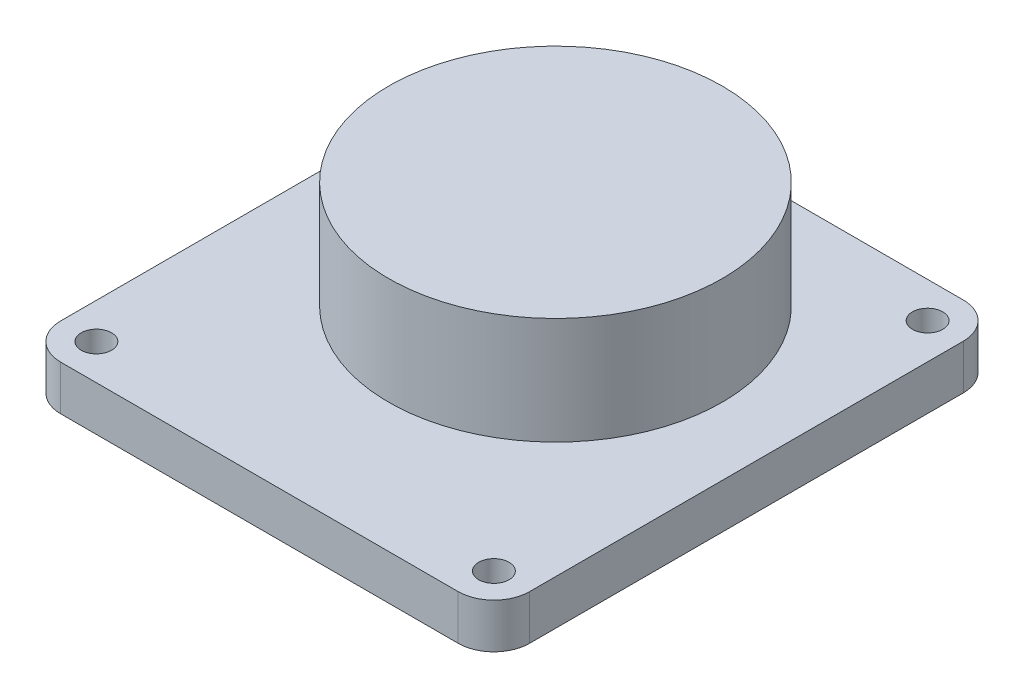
ISO-10303-21;
HEADER;
FILE_DESCRIPTION(('STEP AP214'),'2;1');
FILE_NAME('part.step','',(''),(''),'','','');
FILE_SCHEMA(('AUTOMOTIVE_DESIGN { 1 0 10303 214 1 1 1 1 }'));
ENDSEC;
DATA;
#1=APPLICATION_CONTEXT('core data for automotive mechanical design processes');
#2=APPLICATION_PROTOCOL_DEFINITION('international standard','automotive_design',2000,#1);
#3=PRODUCT_CONTEXT('',#1,'mechanical');
#4=PRODUCT('Part','Part','',(#3));
#5=PRODUCT_RELATED_PRODUCT_CATEGORY('part','',(#4));
#6=PRODUCT_DEFINITION_FORMATION('','',#4);
#7=PRODUCT_DEFINITION_CONTEXT('part definition',#1,'design');
#8=PRODUCT_DEFINITION('design','',#6,#7);
#9=PRODUCT_DEFINITION_SHAPE('','',#8);
#10=(LENGTH_UNIT() NAMED_UNIT(*) SI_UNIT(.MILLI.,.METRE.));
#11=(NAMED_UNIT(*) PLANE_ANGLE_UNIT() SI_UNIT($,.RADIAN.));
#12=(NAMED_UNIT(*) SI_UNIT($,.STERADIAN.) SOLID_ANGLE_UNIT());
#13=UNCERTAINTY_MEASURE_WITH_UNIT(LENGTH_MEASURE(1.E-05),#10,'distance_accuracy_value','');
#14=(GEOMETRIC_REPRESENTATION_CONTEXT(3) GLOBAL_UNCERTAINTY_ASSIGNED_CONTEXT((#13)) GLOBAL_UNIT_ASSIGNED_CONTEXT((#10,
#11,#12)) REPRESENTATION_CONTEXT('',''));
#15=CARTESIAN_POINT('',(0.,0.,0.));
#16=DIRECTION('',(0.,0.,1.));
#17=DIRECTION('',(1.,0.,0.));
#18=AXIS2_PLACEMENT_3D('',#15,#16,#17);
#19=CARTESIAN_POINT('',(2.54,3.1877,0.));
#20=DIRECTION('',(0.,1.,0.));
#21=DIRECTION('',(0.,0.,1.));
#22=AXIS2_PLACEMENT_3D('',#19,#20,#21);
#23=PLANE('',#22);
#24=CARTESIAN_POINT('',(16.68145,3.1877,-18.52295));
#25=DIRECTION('',(0.,1.,0.));
#26=DIRECTION('',(0.,0.,1.));
#27=AXIS2_PLACEMENT_3D('',#24,#25,#26);
#28=CIRCLE('',#27,11.86815);
#29=CARTESIAN_POINT('',(16.68145,3.1877,-30.3911));
#30=VERTEX_POINT('',#29);
#31=EDGE_CURVE('E203',#30,#30,#28,.T.);
#32=ORIENTED_EDGE('',*,*,#31,.F.);
#33=EDGE_LOOP('',(#32));
#34=FACE_BOUND('',#33,.T.);
#35=CARTESIAN_POINT('',(30.8229,3.1877,0.));
#36=DIRECTION('',(0.,1.,0.));
#37=DIRECTION('',(0.,0.,1.));
#38=AXIS2_PLACEMENT_3D('',#35,#36,#37);
#39=CIRCLE('',#38,1.0795);
#40=CARTESIAN_POINT('',(30.8229,3.1877,1.0795));
#41=VERTEX_POINT('',#40);
#42=EDGE_CURVE('E188',#41,#41,#39,.T.);
#43=ORIENTED_EDGE('',*,*,#42,.F.);
#44=EDGE_LOOP('',(#43));
#45=FACE_BOUND('',#44,.T.);
#46=CARTESIAN_POINT('',(2.54,3.1877,-30.861));
#47=DIRECTION('',(0.,1.,0.));
#48=DIRECTION('',(0.,0.,1.));
#49=AXIS2_PLACEMENT_3D('',#46,#47,#48);
#50=CIRCLE('',#49,1.0795);
#51=CARTESIAN_POINT('',(2.54,3.1877,-29.7815));
#52=VERTEX_POINT('',#51);
#53=EDGE_CURVE('E134',#52,#52,#50,.T.);
#54=ORIENTED_EDGE('',*,*,#53,.F.);
#55=EDGE_LOOP('',(#54));
#56=FACE_BOUND('',#55,.T.);
#57=CARTESIAN_POINT('',(2.54,3.1877,0.));
#58=DIRECTION('',(0.,1.,0.));
#59=DIRECTION('',(0.,0.,1.));
#60=AXIS2_PLACEMENT_3D('',#57,#58,#59);
#61=CIRCLE('',#60,2.54);
#62=CARTESIAN_POINT('',(0.,3.1877,0.));
#63=VERTEX_POINT('',#62);
#64=CARTESIAN_POINT('',(2.54,3.1877,2.54));
#65=VERTEX_POINT('',#64);
#66=EDGE_CURVE('E145',#63,#65,#61,.T.);
#67=ORIENTED_EDGE('',*,*,#66,.T.);
#68=DIRECTION('',(1.,0.,0.));
#69=VECTOR('',#68,1.);
#70=CARTESIAN_POINT('',(2.54,3.1877,2.54));
#71=LINE('',#70,#69);
#72=CARTESIAN_POINT('',(30.8229,3.1877,2.54));
#73=VERTEX_POINT('',#72);
#74=EDGE_CURVE('E93',#65,#73,#71,.T.);
#75=ORIENTED_EDGE('',*,*,#74,.T.);
#76=CARTESIAN_POINT('',(30.8229,3.1877,0.));
#77=DIRECTION('',(0.,1.,0.));
#78=DIRECTION('',(0.,0.,-1.));
#79=AXIS2_PLACEMENT_3D('',#76,#77,#78);
#80=CIRCLE('',#79,2.54);
#81=CARTESIAN_POINT('',(33.3629,3.1877,0.));
#82=VERTEX_POINT('',#81);
#83=EDGE_CURVE('E160',#73,#82,#80,.T.);
#84=ORIENTED_EDGE('',*,*,#83,.T.);
#85=DIRECTION('',(0.,0.,-1.));
#86=VECTOR('',#85,1.);
#87=CARTESIAN_POINT('',(33.3629,3.1877,0.));
#88=LINE('',#87,#86);
#89=CARTESIAN_POINT('',(33.3629,3.1877,-30.861));
#90=VERTEX_POINT('',#89);
#91=EDGE_CURVE('E173',#82,#90,#88,.T.);
#92=ORIENTED_EDGE('',*,*,#91,.T.);
#93=CARTESIAN_POINT('',(30.8229,3.1877,-30.861));
#94=DIRECTION('',(0.,1.,0.));
#95=DIRECTION('',(0.,0.,-1.));
#96=AXIS2_PLACEMENT_3D('',#93,#94,#95);
#97=CIRCLE('',#96,2.54);
#98=CARTESIAN_POINT('',(30.8229,3.1877,-33.401));
#99=VERTEX_POINT('',#98);
#100=EDGE_CURVE('E112',#90,#99,#97,.T.);
#101=ORIENTED_EDGE('',*,*,#100,.T.);
#102=DIRECTION('',(-1.,0.,0.));
#103=VECTOR('',#102,1.);
#104=CARTESIAN_POINT('',(2.54,3.1877,-33.401));
#105=LINE('',#104,#103);
#106=CARTESIAN_POINT('',(2.54,3.1877,-33.401));
#107=VERTEX_POINT('',#106);
#108=EDGE_CURVE('E106',#99,#107,#105,.T.);
#109=ORIENTED_EDGE('',*,*,#108,.T.);
#110=CARTESIAN_POINT('',(2.54,3.1877,-30.861));
#111=DIRECTION('',(0.,1.,0.));
#112=DIRECTION('',(0.,0.,-1.));
#113=AXIS2_PLACEMENT_3D('',#110,#111,#112);
#114=CIRCLE('',#113,2.54);
#115=CARTESIAN_POINT('',(0.,3.1877,-30.861));
#116=VERTEX_POINT('',#115);
#117=EDGE_CURVE('E110',#107,#116,#114,.T.);
#118=ORIENTED_EDGE('',*,*,#117,.T.);
#119=DIRECTION('',(0.,0.,1.));
#120=VECTOR('',#119,1.);
#121=CARTESIAN_POINT('',(0.,3.1877,0.));
#122=LINE('',#121,#120);
#123=EDGE_CURVE('E50',#116,#63,#122,.T.);
#124=ORIENTED_EDGE('',*,*,#123,.T.);
#125=EDGE_LOOP('',(#67,#75,#84,#92,#101,#109,#118,#124));
#126=FACE_BOUND('',#125,.T.);
#127=CARTESIAN_POINT('',(30.8229,3.1877,-30.861));
#128=DIRECTION('',(0.,1.,0.));
#129=DIRECTION('',(0.,0.,1.));
#130=AXIS2_PLACEMENT_3D('',#127,#128,#129);
#131=CIRCLE('',#130,1.0795);
#132=CARTESIAN_POINT('',(30.8229,3.1877,-29.7815));
#133=VERTEX_POINT('',#132);
#134=EDGE_CURVE('E182',#133,#133,#131,.T.);
#135=ORIENTED_EDGE('',*,*,#134,.F.);
#136=EDGE_LOOP('',(#135));
#137=FACE_BOUND('',#136,.T.);
#138=CARTESIAN_POINT('',(2.54,3.1877,0.));
#139=DIRECTION('',(0.,1.,0.));
#140=DIRECTION('',(0.,0.,1.));
#141=AXIS2_PLACEMENT_3D('',#138,#139,#140);
#142=CIRCLE('',#141,1.0795);
#143=CARTESIAN_POINT('',(2.54,3.1877,1.0795));
#144=VERTEX_POINT('',#143);
#145=EDGE_CURVE('E194',#144,#144,#142,.T.);
#146=ORIENTED_EDGE('',*,*,#145,.F.);
#147=EDGE_LOOP('',(#146));
#148=FACE_BOUND('',#147,.T.);
#149=ADVANCED_FACE('F33',(#34,#45,#56,#126,#137,#148),#23,.T.);
#150=CARTESIAN_POINT('',(2.54,0.,0.));
#151=DIRECTION('',(0.,1.,0.));
#152=DIRECTION('',(0.,0.,1.));
#153=AXIS2_PLACEMENT_3D('',#150,#151,#152);
#154=PLANE('',#153);
#155=CARTESIAN_POINT('',(2.54,0.,0.));
#156=DIRECTION('',(0.,1.,0.));
#157=DIRECTION('',(0.,0.,1.));
#158=AXIS2_PLACEMENT_3D('',#155,#156,#157);
#159=CIRCLE('',#158,2.54);
#160=CARTESIAN_POINT('',(0.,0.,0.));
#161=VERTEX_POINT('',#160);
#162=CARTESIAN_POINT('',(2.54,0.,2.54));
#163=VERTEX_POINT('',#162);
#164=EDGE_CURVE('E130',#161,#163,#159,.T.);
#165=ORIENTED_EDGE('',*,*,#164,.F.);
#166=DIRECTION('',(0.,0.,1.));
#167=VECTOR('',#166,1.);
#168=CARTESIAN_POINT('',(0.,0.,0.));
#169=LINE('',#168,#167);
#170=CARTESIAN_POINT('',(0.,0.,-30.861));
#171=VERTEX_POINT('',#170);
#172=EDGE_CURVE('E85',#171,#161,#169,.T.);
#173=ORIENTED_EDGE('',*,*,#172,.F.);
#174=CARTESIAN_POINT('',(2.54,0.,-30.861));
#175=DIRECTION('',(0.,1.,0.));
#176=DIRECTION('',(0.,0.,-1.));
#177=AXIS2_PLACEMENT_3D('',#174,#175,#176);
#178=CIRCLE('',#177,2.54);
#179=CARTESIAN_POINT('',(2.54,0.,-33.401));
#180=VERTEX_POINT('',#179);
#181=EDGE_CURVE('E79',#180,#171,#178,.T.);
#182=ORIENTED_EDGE('',*,*,#181,.F.);
#183=DIRECTION('',(-1.,0.,0.));
#184=VECTOR('',#183,1.);
#185=CARTESIAN_POINT('',(2.54,0.,-33.401));
#186=LINE('',#185,#184);
#187=CARTESIAN_POINT('',(30.8229,0.,-33.401));
#188=VERTEX_POINT('',#187);
#189=EDGE_CURVE('E120',#188,#180,#186,.T.);
#190=ORIENTED_EDGE('',*,*,#189,.F.);
#191=CARTESIAN_POINT('',(30.8229,0.,-30.861));
#192=DIRECTION('',(0.,1.,0.));
#193=DIRECTION('',(0.,0.,-1.));
#194=AXIS2_PLACEMENT_3D('',#191,#192,#193);
#195=CIRCLE('',#194,2.54);
#196=CARTESIAN_POINT('',(33.3629,0.,-30.861));
#197=VERTEX_POINT('',#196);
#198=EDGE_CURVE('E140',#197,#188,#195,.T.);
#199=ORIENTED_EDGE('',*,*,#198,.F.);
#200=DIRECTION('',(0.,0.,-1.));
#201=VECTOR('',#200,1.);
#202=CARTESIAN_POINT('',(33.3629,0.,0.));
#203=LINE('',#202,#201);
#204=CARTESIAN_POINT('',(33.3629,0.,0.));
#205=VERTEX_POINT('',#204);
#206=EDGE_CURVE('E138',#205,#197,#203,.T.);
#207=ORIENTED_EDGE('',*,*,#206,.F.);
#208=CARTESIAN_POINT('',(30.8229,0.,0.));
#209=DIRECTION('',(0.,1.,0.));
#210=DIRECTION('',(0.,0.,-1.));
#211=AXIS2_PLACEMENT_3D('',#208,#209,#210);
#212=CIRCLE('',#211,2.54);
#213=CARTESIAN_POINT('',(30.8229,0.,2.54));
#214=VERTEX_POINT('',#213);
#215=EDGE_CURVE('E136',#214,#205,#212,.T.);
#216=ORIENTED_EDGE('',*,*,#215,.F.);
#217=DIRECTION('',(1.,0.,0.));
#218=VECTOR('',#217,1.);
#219=CARTESIAN_POINT('',(2.54,0.,2.54));
#220=LINE('',#219,#218);
#221=EDGE_CURVE('E133',#163,#214,#220,.T.);
#222=ORIENTED_EDGE('',*,*,#221,.F.);
#223=EDGE_LOOP('',(#165,#173,#182,#190,#199,#207,#216,#222));
#224=FACE_BOUND('',#223,.T.);
#225=CARTESIAN_POINT('',(2.54,0.,-30.861));
#226=DIRECTION('',(0.,1.,0.));
#227=DIRECTION('',(0.,0.,1.));
#228=AXIS2_PLACEMENT_3D('',#225,#226,#227);
#229=CIRCLE('',#228,1.0795);
#230=CARTESIAN_POINT('',(2.54,0.,-29.7815));
#231=VERTEX_POINT('',#230);
#232=EDGE_CURVE('E179',#231,#231,#229,.T.);
#233=ORIENTED_EDGE('',*,*,#232,.T.);
#234=EDGE_LOOP('',(#233));
#235=FACE_BOUND('',#234,.T.);
#236=CARTESIAN_POINT('',(30.8229,0.,-30.861));
#237=DIRECTION('',(0.,1.,0.));
#238=DIRECTION('',(0.,0.,1.));
#239=AXIS2_PLACEMENT_3D('',#236,#237,#238);
#240=CIRCLE('',#239,1.0795);
#241=CARTESIAN_POINT('',(30.8229,0.,-29.7815));
#242=VERTEX_POINT('',#241);
#243=EDGE_CURVE('E185',#242,#242,#240,.T.);
#244=ORIENTED_EDGE('',*,*,#243,.T.);
#245=EDGE_LOOP('',(#244));
#246=FACE_BOUND('',#245,.T.);
#247=CARTESIAN_POINT('',(30.8229,0.,0.));
#248=DIRECTION('',(0.,1.,0.));
#249=DIRECTION('',(0.,0.,1.));
#250=AXIS2_PLACEMENT_3D('',#247,#248,#249);
#251=CIRCLE('',#250,1.0795);
#252=CARTESIAN_POINT('',(30.8229,0.,1.0795));
#253=VERTEX_POINT('',#252);
#254=EDGE_CURVE('E191',#253,#253,#251,.T.);
#255=ORIENTED_EDGE('',*,*,#254,.T.);
#256=EDGE_LOOP('',(#255));
#257=FACE_BOUND('',#256,.T.);
#258=CARTESIAN_POINT('',(2.54,0.,0.));
#259=DIRECTION('',(0.,1.,0.));
#260=DIRECTION('',(0.,0.,1.));
#261=AXIS2_PLACEMENT_3D('',#258,#259,#260);
#262=CIRCLE('',#261,1.0795);
#263=CARTESIAN_POINT('',(2.54,0.,1.0795));
#264=VERTEX_POINT('',#263);
#265=EDGE_CURVE('E197',#264,#264,#262,.T.);
#266=ORIENTED_EDGE('',*,*,#265,.T.);
#267=EDGE_LOOP('',(#266));
#268=FACE_BOUND('',#267,.T.);
#269=ADVANCED_FACE('F164',(#224,#235,#246,#257,#268),#154,.F.);
#270=CARTESIAN_POINT('',(2.54,3.1877,0.));
#271=DIRECTION('',(0.,-1.,0.));
#272=DIRECTION('',(0.,0.,-1.));
#273=AXIS2_PLACEMENT_3D('',#270,#271,#272);
#274=CYLINDRICAL_SURFACE('',#273,2.54);
#275=ORIENTED_EDGE('',*,*,#164,.T.);
#276=DIRECTION('',(0.,-1.,0.));
#277=VECTOR('',#276,1.);
#278=CARTESIAN_POINT('',(2.54,3.1877,2.54));
#279=LINE('',#278,#277);
#280=EDGE_CURVE('E11',#65,#163,#279,.T.);
#281=ORIENTED_EDGE('',*,*,#280,.F.);
#282=ORIENTED_EDGE('',*,*,#66,.F.);
#283=DIRECTION('',(0.,-1.,0.));
#284=VECTOR('',#283,1.);
#285=CARTESIAN_POINT('',(0.,3.1877,0.));
#286=LINE('',#285,#284);
#287=EDGE_CURVE('E126',#63,#161,#286,.T.);
#288=ORIENTED_EDGE('',*,*,#287,.T.);
#289=EDGE_LOOP('',(#275,#281,#282,#288));
#290=FACE_BOUND('',#289,.T.);
#291=ADVANCED_FACE('F35',(#290),#274,.T.);
#292=CARTESIAN_POINT('',(2.54,3.1877,2.54));
#293=DIRECTION('',(0.,0.,-1.));
#294=DIRECTION('',(-1.,0.,0.));
#295=AXIS2_PLACEMENT_3D('',#292,#293,#294);
#296=PLANE('',#295);
#297=ORIENTED_EDGE('',*,*,#221,.T.);
#298=DIRECTION('',(0.,-1.,0.));
#299=VECTOR('',#298,1.);
#300=CARTESIAN_POINT('',(30.8229,3.1877,2.54));
#301=LINE('',#300,#299);
#302=EDGE_CURVE('E42',#73,#214,#301,.T.);
#303=ORIENTED_EDGE('',*,*,#302,.F.);
#304=ORIENTED_EDGE('',*,*,#74,.F.);
#305=ORIENTED_EDGE('',*,*,#280,.T.);
#306=EDGE_LOOP('',(#297,#303,#304,#305));
#307=FACE_BOUND('',#306,.T.);
#308=ADVANCED_FACE('F266',(#307),#296,.F.);
#309=CARTESIAN_POINT('',(30.8229,3.1877,0.));
#310=DIRECTION('',(0.,-1.,0.));
#311=DIRECTION('',(0.,0.,-1.));
#312=AXIS2_PLACEMENT_3D('',#309,#310,#311);
#313=CYLINDRICAL_SURFACE('',#312,2.54);
#314=ORIENTED_EDGE('',*,*,#215,.T.);
#315=DIRECTION('',(0.,-1.,0.));
#316=VECTOR('',#315,1.);
#317=CARTESIAN_POINT('',(33.3629,3.1877,0.));
#318=LINE('',#317,#316);
#319=EDGE_CURVE('E152',#82,#205,#318,.T.);
#320=ORIENTED_EDGE('',*,*,#319,.F.);
#321=ORIENTED_EDGE('',*,*,#83,.F.);
#322=ORIENTED_EDGE('',*,*,#302,.T.);
#323=EDGE_LOOP('',(#314,#320,#321,#322));
#324=FACE_BOUND('',#323,.T.);
#325=ADVANCED_FACE('F158',(#324),#313,.T.);
#326=CARTESIAN_POINT('',(33.3629,3.1877,0.));
#327=DIRECTION('',(-1.,0.,0.));
#328=DIRECTION('',(0.,0.,1.));
#329=AXIS2_PLACEMENT_3D('',#326,#327,#328);
#330=PLANE('',#329);
#331=ORIENTED_EDGE('',*,*,#206,.T.);
#332=DIRECTION('',(0.,-1.,0.));
#333=VECTOR('',#332,1.);
#334=CARTESIAN_POINT('',(33.3629,3.1877,-30.861));
#335=LINE('',#334,#333);
#336=EDGE_CURVE('E149',#90,#197,#335,.T.);
#337=ORIENTED_EDGE('',*,*,#336,.F.);
#338=ORIENTED_EDGE('',*,*,#91,.F.);
#339=ORIENTED_EDGE('',*,*,#319,.T.);
#340=EDGE_LOOP('',(#331,#337,#338,#339));
#341=FACE_BOUND('',#340,.T.);
#342=ADVANCED_FACE('F169',(#341),#330,.F.);
#343=CARTESIAN_POINT('',(30.8229,3.1877,-30.861));
#344=DIRECTION('',(0.,-1.,0.));
#345=DIRECTION('',(0.,0.,-1.));
#346=AXIS2_PLACEMENT_3D('',#343,#344,#345);
#347=CYLINDRICAL_SURFACE('',#346,2.54);
#348=ORIENTED_EDGE('',*,*,#198,.T.);
#349=DIRECTION('',(0.,-1.,0.));
#350=VECTOR('',#349,1.);
#351=CARTESIAN_POINT('',(30.8229,3.1877,-33.401));
#352=LINE('',#351,#350);
#353=EDGE_CURVE('E121',#99,#188,#352,.T.);
#354=ORIENTED_EDGE('',*,*,#353,.F.);
#355=ORIENTED_EDGE('',*,*,#100,.F.);
#356=ORIENTED_EDGE('',*,*,#336,.T.);
#357=EDGE_LOOP('',(#348,#354,#355,#356));
#358=FACE_BOUND('',#357,.T.);
#359=ADVANCED_FACE('F172',(#358),#347,.T.);
#360=CARTESIAN_POINT('',(2.54,3.1877,-33.401));
#361=DIRECTION('',(0.,0.,1.));
#362=DIRECTION('',(1.,0.,0.));
#363=AXIS2_PLACEMENT_3D('',#360,#361,#362);
#364=PLANE('',#363);
#365=ORIENTED_EDGE('',*,*,#189,.T.);
#366=DIRECTION('',(0.,-1.,0.));
#367=VECTOR('',#366,1.);
#368=CARTESIAN_POINT('',(2.54,3.1877,-33.401));
#369=LINE('',#368,#367);
#370=EDGE_CURVE('E117',#107,#180,#369,.T.);
#371=ORIENTED_EDGE('',*,*,#370,.F.);
#372=ORIENTED_EDGE('',*,*,#108,.F.);
#373=ORIENTED_EDGE('',*,*,#353,.T.);
#374=EDGE_LOOP('',(#365,#371,#372,#373));
#375=FACE_BOUND('',#374,.T.);
#376=ADVANCED_FACE('F118',(#375),#364,.F.);
#377=CARTESIAN_POINT('',(2.54,3.1877,-30.861));
#378=DIRECTION('',(0.,-1.,0.));
#379=DIRECTION('',(0.,0.,-1.));
#380=AXIS2_PLACEMENT_3D('',#377,#378,#379);
#381=CYLINDRICAL_SURFACE('',#380,2.54);
#382=ORIENTED_EDGE('',*,*,#181,.T.);
#383=DIRECTION('',(0.,-1.,0.));
#384=VECTOR('',#383,1.);
#385=CARTESIAN_POINT('',(0.,3.1877,-30.861));
#386=LINE('',#385,#384);
#387=EDGE_CURVE('E122',#116,#171,#386,.T.);
#388=ORIENTED_EDGE('',*,*,#387,.F.);
#389=ORIENTED_EDGE('',*,*,#117,.F.);
#390=ORIENTED_EDGE('',*,*,#370,.T.);
#391=EDGE_LOOP('',(#382,#388,#389,#390));
#392=FACE_BOUND('',#391,.T.);
#393=ADVANCED_FACE('F124',(#392),#381,.T.);
#394=CARTESIAN_POINT('',(0.,3.1877,0.));
#395=DIRECTION('',(1.,0.,0.));
#396=DIRECTION('',(0.,0.,-1.));
#397=AXIS2_PLACEMENT_3D('',#394,#395,#396);
#398=PLANE('',#397);
#399=ORIENTED_EDGE('',*,*,#172,.T.);
#400=ORIENTED_EDGE('',*,*,#287,.F.);
#401=ORIENTED_EDGE('',*,*,#123,.F.);
#402=ORIENTED_EDGE('',*,*,#387,.T.);
#403=EDGE_LOOP('',(#399,#400,#401,#402));
#404=FACE_BOUND('',#403,.T.);
#405=ADVANCED_FACE('F229',(#404),#398,.F.);
#406=CARTESIAN_POINT('',(2.54,3.1877,-30.861));
#407=DIRECTION('',(0.,-1.,0.));
#408=DIRECTION('',(0.,0.,-1.));
#409=AXIS2_PLACEMENT_3D('',#406,#407,#408);
#410=CYLINDRICAL_SURFACE('',#409,1.0795);
#411=ORIENTED_EDGE('',*,*,#53,.T.);
#412=EDGE_LOOP('',(#411));
#413=FACE_BOUND('',#412,.T.);
#414=ORIENTED_EDGE('',*,*,#232,.F.);
#415=EDGE_LOOP('',(#414));
#416=FACE_BOUND('',#415,.T.);
#417=ADVANCED_FACE('F225',(#413,#416),#410,.F.);
#418=CARTESIAN_POINT('',(30.8229,3.1877,-30.861));
#419=DIRECTION('',(0.,-1.,0.));
#420=DIRECTION('',(0.,0.,-1.));
#421=AXIS2_PLACEMENT_3D('',#418,#419,#420);
#422=CYLINDRICAL_SURFACE('',#421,1.0795);
#423=ORIENTED_EDGE('',*,*,#134,.T.);
#424=EDGE_LOOP('',(#423));
#425=FACE_BOUND('',#424,.T.);
#426=ORIENTED_EDGE('',*,*,#243,.F.);
#427=EDGE_LOOP('',(#426));
#428=FACE_BOUND('',#427,.T.);
#429=ADVANCED_FACE('F228',(#425,#428),#422,.F.);
#430=CARTESIAN_POINT('',(30.8229,3.1877,0.));
#431=DIRECTION('',(0.,-1.,0.));
#432=DIRECTION('',(0.,0.,-1.));
#433=AXIS2_PLACEMENT_3D('',#430,#431,#432);
#434=CYLINDRICAL_SURFACE('',#433,1.0795);
#435=ORIENTED_EDGE('',*,*,#42,.T.);
#436=EDGE_LOOP('',(#435));
#437=FACE_BOUND('',#436,.T.);
#438=ORIENTED_EDGE('',*,*,#254,.F.);
#439=EDGE_LOOP('',(#438));
#440=FACE_BOUND('',#439,.T.);
#441=ADVANCED_FACE('F242',(#437,#440),#434,.F.);
#442=CARTESIAN_POINT('',(2.54,3.1877,0.));
#443=DIRECTION('',(0.,-1.,0.));
#444=DIRECTION('',(0.,0.,-1.));
#445=AXIS2_PLACEMENT_3D('',#442,#443,#444);
#446=CYLINDRICAL_SURFACE('',#445,1.0795);
#447=ORIENTED_EDGE('',*,*,#145,.T.);
#448=EDGE_LOOP('',(#447));
#449=FACE_BOUND('',#448,.T.);
#450=ORIENTED_EDGE('',*,*,#265,.F.);
#451=EDGE_LOOP('',(#450));
#452=FACE_BOUND('',#451,.T.);
#453=ADVANCED_FACE('F214',(#449,#452),#446,.F.);
#454=CARTESIAN_POINT('',(16.68145,10.8077,-18.52295));
#455=DIRECTION('',(0.,-1.,0.));
#456=DIRECTION('',(0.,0.,-1.));
#457=AXIS2_PLACEMENT_3D('',#454,#455,#456);
#458=CYLINDRICAL_SURFACE('',#457,11.86815);
#459=CARTESIAN_POINT('',(16.68145,10.8077,-18.52295));
#460=DIRECTION('',(0.,1.,0.));
#461=DIRECTION('',(0.,0.,1.));
#462=AXIS2_PLACEMENT_3D('',#459,#460,#461);
#463=CIRCLE('',#462,11.86815);
#464=CARTESIAN_POINT('',(16.68145,10.8077,-30.3911));
#465=VERTEX_POINT('',#464);
#466=EDGE_CURVE('E200',#465,#465,#463,.T.);
#467=CARTESIAN_POINT('',(16.68145,10.8077,-30.3911));
#468=CARTESIAN_POINT('',(16.68145,10.728325,-30.3911));
#469=CARTESIAN_POINT('',(16.68145,10.64895,-30.3911));
#470=CARTESIAN_POINT('',(16.68145,10.4902,-30.3911));
#471=CARTESIAN_POINT('',(16.68145,10.410825,-30.3911));
#472=CARTESIAN_POINT('',(16.68145,10.252075,-30.3911));
#473=CARTESIAN_POINT('',(16.68145,10.1727,-30.3911));
#474=CARTESIAN_POINT('',(16.68145,10.01395,-30.3911));
#475=CARTESIAN_POINT('',(16.68145,9.934575,-30.3911));
#476=CARTESIAN_POINT('',(16.68145,9.775825,-30.3911));
#477=CARTESIAN_POINT('',(16.68145,9.69645,-30.3911));
#478=CARTESIAN_POINT('',(16.68145,9.5377,-30.3911));
#479=CARTESIAN_POINT('',(16.68145,9.458325,-30.3911));
#480=CARTESIAN_POINT('',(16.68145,9.299575,-30.3911));
#481=CARTESIAN_POINT('',(16.68145,9.2202,-30.3911));
#482=CARTESIAN_POINT('',(16.68145,9.06145,-30.3911));
#483=CARTESIAN_POINT('',(16.68145,8.982075,-30.3911));
#484=CARTESIAN_POINT('',(16.68145,8.823325,-30.3911));
#485=CARTESIAN_POINT('',(16.68145,8.74395,-30.3911));
#486=CARTESIAN_POINT('',(16.68145,8.5852,-30.3911));
#487=CARTESIAN_POINT('',(16.68145,8.505825,-30.3911));
#488=CARTESIAN_POINT('',(16.68145,8.347075,-30.3911));
#489=CARTESIAN_POINT('',(16.68145,8.2677,-30.3911));
#490=CARTESIAN_POINT('',(16.68145,8.10895,-30.3911));
#491=CARTESIAN_POINT('',(16.68145,8.029575,-30.3911));
#492=CARTESIAN_POINT('',(16.68145,7.870825,-30.3911));
#493=CARTESIAN_POINT('',(16.68145,7.79145,-30.3911));
#494=CARTESIAN_POINT('',(16.68145,7.6327,-30.3911));
#495=CARTESIAN_POINT('',(16.68145,7.553325,-30.3911));
#496=CARTESIAN_POINT('',(16.68145,7.394575,-30.3911));
#497=CARTESIAN_POINT('',(16.68145,7.3152,-30.3911));
#498=CARTESIAN_POINT('',(16.68145,7.15645,-30.3911));
#499=CARTESIAN_POINT('',(16.68145,7.077075,-30.3911));
#500=CARTESIAN_POINT('',(16.68145,6.918325,-30.3911));
#501=CARTESIAN_POINT('',(16.68145,6.83895,-30.3911));
#502=CARTESIAN_POINT('',(16.68145,6.6802,-30.3911));
#503=CARTESIAN_POINT('',(16.68145,6.600825,-30.3911));
#504=CARTESIAN_POINT('',(16.68145,6.442075,-30.3911));
#505=CARTESIAN_POINT('',(16.68145,6.3627,-30.3911));
#506=CARTESIAN_POINT('',(16.68145,6.20395,-30.3911));
#507=CARTESIAN_POINT('',(16.68145,6.124575,-30.3911));
#508=CARTESIAN_POINT('',(16.68145,5.965825,-30.3911));
#509=CARTESIAN_POINT('',(16.68145,5.88645,-30.3911));
#510=CARTESIAN_POINT('',(16.68145,5.7277,-30.3911));
#511=CARTESIAN_POINT('',(16.68145,5.648325,-30.3911));
#512=CARTESIAN_POINT('',(16.68145,5.489575,-30.3911));
#513=CARTESIAN_POINT('',(16.68145,5.4102,-30.3911));
#514=CARTESIAN_POINT('',(16.68145,5.25145,-30.3911));
#515=CARTESIAN_POINT('',(16.68145,5.172075,-30.3911));
#516=CARTESIAN_POINT('',(16.68145,5.013325,-30.3911));
#517=CARTESIAN_POINT('',(16.68145,4.93395,-30.3911));
#518=CARTESIAN_POINT('',(16.68145,4.7752,-30.3911));
#519=CARTESIAN_POINT('',(16.68145,4.695825,-30.3911));
#520=CARTESIAN_POINT('',(16.68145,4.537075,-30.3911));
#521=CARTESIAN_POINT('',(16.68145,4.4577,-30.3911));
#522=CARTESIAN_POINT('',(16.68145,4.29895,-30.3911));
#523=CARTESIAN_POINT('',(16.68145,4.219575,-30.3911));
#524=CARTESIAN_POINT('',(16.68145,4.060825,-30.3911));
#525=CARTESIAN_POINT('',(16.68145,3.98145,-30.3911));
#526=CARTESIAN_POINT('',(16.68145,3.8227,-30.3911));
#527=CARTESIAN_POINT('',(16.68145,3.743325,-30.3911));
#528=CARTESIAN_POINT('',(16.68145,3.584575,-30.3911));
#529=CARTESIAN_POINT('',(16.68145,3.5052,-30.3911));
#530=CARTESIAN_POINT('',(16.68145,3.34645,-30.3911));
#531=CARTESIAN_POINT('',(16.68145,3.267075,-30.3911));
#532=CARTESIAN_POINT('',(16.68145,3.1877,-30.3911));
#533=B_SPLINE_CURVE_WITH_KNOTS('',3,(#467,#468,#469,#470,#471,#472,#473,#474,#475,#476,#477,
#478,#479,#480,#481,#482,#483,#484,#485,#486,#487,#488,#489,#490,#491,#492,#493,#494,#495,#496,
#497,#498,#499,#500,#501,#502,#503,#504,#505,#506,#507,#508,#509,#510,#511,#512,#513,#514,#515,
#516,#517,#518,#519,#520,#521,#522,#523,#524,#525,#526,#527,#528,#529,#530,#531,#532),
.UNSPECIFIED.,.F.,.F.,(4,2,2,2,2,2,2,2,2,2,2,2,2,2,2,2,2,2,2,2,2,2,2,2,2,2,2,2,2,2,2,2,4),(0.,
0.238124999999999,0.476249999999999,0.714375,0.952499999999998,1.190625,1.42875,1.666875,1.905,
2.143125,2.38125,2.619375,2.8575,3.095625,3.33375,3.571875,3.81,4.048125,4.28625,4.524375,
4.7625,5.000625,5.23875,5.476875,5.715,5.953125,6.19125,6.429375,6.6675,6.905625,7.14375,
7.381875,7.62),.UNSPECIFIED.);
#534=EDGE_CURVE('BSEAM211',#465,#30,#533,.T.);
#535=ORIENTED_EDGE('',*,*,#466,.F.);
#536=ORIENTED_EDGE('',*,*,#31,.T.);
#537=ORIENTED_EDGE('',*,*,#534,.T.);
#538=ORIENTED_EDGE('',*,*,#534,.F.);
#539=EDGE_LOOP('',(#535,#537,#536,#538));
#540=FACE_BOUND('',#539,.T.);
#541=ADVANCED_FACE('F211',(#540),#458,.T.);
#542=CARTESIAN_POINT('',(16.68145,10.8077,-18.52295));
#543=DIRECTION('',(0.,1.,0.));
#544=DIRECTION('',(0.,0.,1.));
#545=AXIS2_PLACEMENT_3D('',#542,#543,#544);
#546=PLANE('',#545);
#547=ORIENTED_EDGE('',*,*,#466,.T.);
#548=EDGE_LOOP('',(#547));
#549=FACE_BOUND('',#548,.T.);
#550=ADVANCED_FACE('F209',(#549),#546,.T.);
#551=CLOSED_SHELL('',(#149,#269,#291,#308,#325,#342,#359,#376,#393,#405,#417,#429,#441,#453,
#541,#550));
#552=MANIFOLD_SOLID_BREP('B2',#551);
#553=ADVANCED_BREP_SHAPE_REPRESENTATION('',(#18,#552),#14);
#554=SHAPE_DEFINITION_REPRESENTATION(#9,#553);
ENDSEC;
END-ISO-10303-21;
